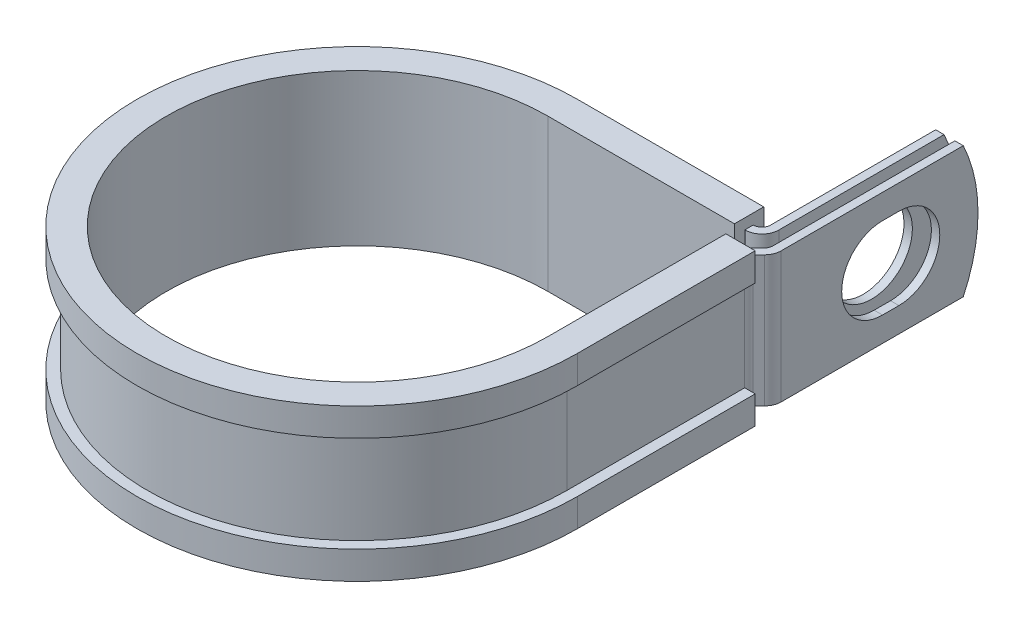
from build123d import *

# Parameters (mm, degrees)
EXTRUDE_THIN1_DEPTH = 9.525
SKETCH2_R           = 5.9436
CUT_EXTRUDE1_DEPTH  = 1.2192
CUT_EXTRUDE2_DEPTH  = 1.2192
CUT_EXTRUDE3_DEPTH  = 84.181065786


with BuildPart() as part:
    # Sketch1 → Extrude-Thin1 (new, symmetric)
    with BuildSketch(Plane(origin=(0, 0, 0), x_dir=(1, 0, 0), z_dir=(0, 1, 0))):
        with BuildLine():
            Line((31.1963698, 57.9374), (31.1963698, 29.2989))
            ThreePointArc((31.1963698, 29.2989), (31.103563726, 28.832332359), (30.839274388, 28.436795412))
            Line((30.839274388, 28.436795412), (30.013090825, 27.610611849))
            ThreePointArc((30.013090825, 27.610611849), (29.484512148, 26.819537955), (29.2989, 25.886402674))
            Line((29.2989, 25.886402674), (29.2989, 0))
            ThreePointArc((29.2989, 0), (-20.717450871, -20.717450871), (0, 29.2989))
            Line((0, 29.2989), (27.1831698, 29.2989))
            ThreePointArc((27.1831698, 29.2989), (28.907378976, 30.013090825), (29.6215698, 31.7373))
            Line((29.6215698, 31.7373), (29.6215698, 57.9374))
            Line((29.6215698, 57.9374), (28.4023698, 57.9374))
            Line((28.4023698, 57.9374), (28.4023698, 31.7373))
            ThreePointArc((28.4023698, 31.7373), (28.045274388, 30.875195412), (27.1831698, 30.5181))
            Line((27.1831698, 30.5181), (0, 30.5181))
            ThreePointArc((0, 30.5181), (-21.579555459, -21.579555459), (30.5181, 0))
            Line((30.5181, 0), (30.5181, 25.886402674))
            ThreePointArc((30.5181, 25.886402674), (30.610906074, 26.352970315), (30.875195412, 26.748507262))
            Line((30.875195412, 26.748507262), (31.701378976, 27.574690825))
            ThreePointArc((31.701378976, 27.574690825), (32.229957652, 28.365764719), (32.4155698, 29.2989))
            Line((32.4155698, 29.2989), (32.4155698, 57.9374))
            Line((32.4155698, 57.9374), (31.1963698, 57.9374))
        make_face()
    extrude(amount=EXTRUDE_THIN1_DEPTH, both=True)

    # Sketch2 → Cut-Extrude1 (cut)
    with BuildSketch(Plane.ZY.offset(-28.4023698)):
        with Locations((-45.2374, 0)):
            Circle(SKETCH2_R)
    extrude(amount=-CUT_EXTRUDE1_DEPTH, mode=Mode.SUBTRACT)

    # Sketch3 → Cut-Extrude2 (cut)
    with BuildSketch(Plane(origin=(32.4155698, 0, 0), x_dir=(0, 0, -1), z_dir=(1, 0, 0))):
        with BuildLine():
            Line((44.0436, 5.9436), (46.4312, 5.9436))
            ThreePointArc((46.4312, 5.9436), (52.3748, 0), (46.4312, -5.9436))
            Line((46.4312, -5.9436), (44.0436, -5.9436))
            ThreePointArc((44.0436, -5.9436), (38.1, 0), (44.0436, 5.9436))
        make_face()
    extrude(amount=-CUT_EXTRUDE2_DEPTH, mode=Mode.SUBTRACT)

    # Sketch4 → Cut-Extrude3 (cut, through all)
    with BuildSketch(Plane.ZY.offset(-28.4023698)):
        with BuildLine():
            Line((-55.792863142, 9.525), (-57.9374, 9.525))
            Line((-57.9374, 9.525), (-57.9374, -2.73e-07))
            ThreePointArc((-57.9374, -2.73e-07), (-57.394638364, 4.881717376), (-55.792863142, 9.525))
        make_face()
        with BuildLine():
            ThreePointArc((-55.792863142, -9.525), (-57.394638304, -4.881717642), (-57.9374, -2.73e-07))
            Line((-57.9374, -2.73e-07), (-57.9374, -9.525))
            Line((-57.9374, -9.525), (-55.792863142, -9.525))
        make_face()
    extrude(amount=-CUT_EXTRUDE3_DEPTH, mode=Mode.SUBTRACT)

    # Sweep1: sweep along a path in Sketch6
    with BuildLine(Plane(origin=(0, 9.525, 0), x_dir=(1, 0, 0), z_dir=(0, 1, 0))) as sweep1_path:
        Line((27.7749, 25.886402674), (27.7749, 0))
        ThreePointArc((27.7749, 0), (-19.639820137, -19.639820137), (0, 27.7749))
        Line((0, 27.7749), (27.1323698, 27.7749))
    # Sketch5 → Sweep1 (sweep)
    with BuildSketch(Plane(origin=(0, 0, -25.886402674), x_dir=(-1, 0, 0), z_dir=(0, 0, -1))):
        Polygon((-30.5181, 9.525), (-29.2989, 9.525), (-29.2989, -9.525), (-30.5181, -9.525), (-30.5181, -6.985), (-32.0421, -6.985), (-32.0421, -11.049), (-27.7749, -11.049), (-27.7749, 11.049), (-32.0421, 11.049), (-32.0421, 6.985), (-30.5181, 6.985), align=None)
    sweep(path=sweep1_path.line)


solid = part.part
